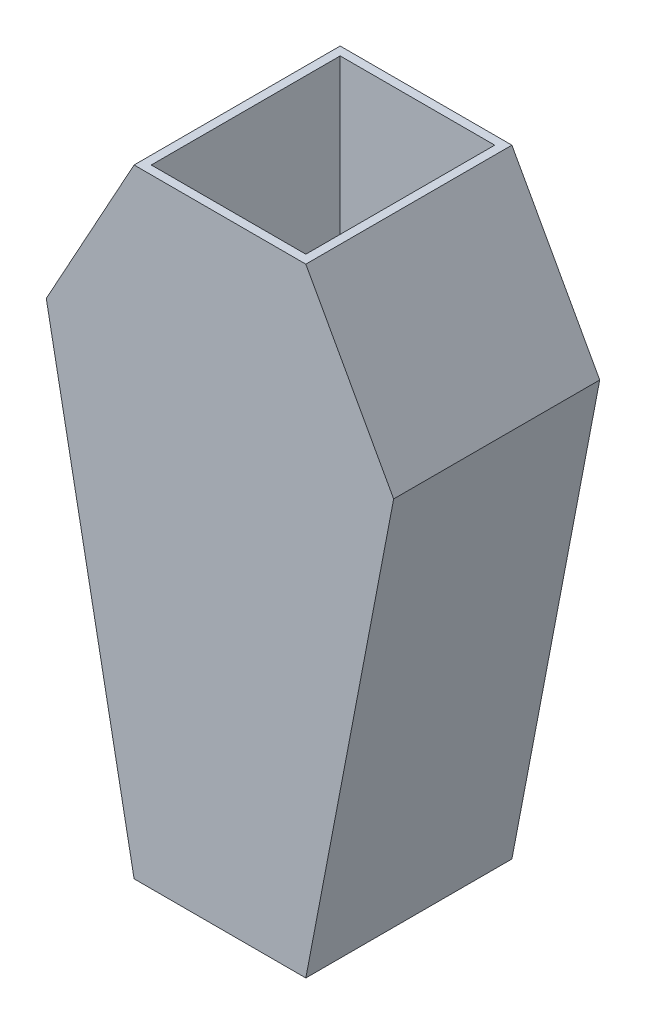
ISO-10303-21;
HEADER;
FILE_DESCRIPTION(('STEP AP214'),'2;1');
FILE_NAME('part.step','',(''),(''),'','','');
FILE_SCHEMA(('AUTOMOTIVE_DESIGN { 1 0 10303 214 1 1 1 1 }'));
ENDSEC;
DATA;
#1=APPLICATION_CONTEXT('core data for automotive mechanical design processes');
#2=APPLICATION_PROTOCOL_DEFINITION('international standard','automotive_design',2000,#1);
#3=PRODUCT_CONTEXT('',#1,'mechanical');
#4=PRODUCT('Part','Part','',(#3));
#5=PRODUCT_RELATED_PRODUCT_CATEGORY('part','',(#4));
#6=PRODUCT_DEFINITION_FORMATION('','',#4);
#7=PRODUCT_DEFINITION_CONTEXT('part definition',#1,'design');
#8=PRODUCT_DEFINITION('design','',#6,#7);
#9=PRODUCT_DEFINITION_SHAPE('','',#8);
#10=(LENGTH_UNIT() NAMED_UNIT(*) SI_UNIT(.MILLI.,.METRE.));
#11=(NAMED_UNIT(*) PLANE_ANGLE_UNIT() SI_UNIT($,.RADIAN.));
#12=(NAMED_UNIT(*) SI_UNIT($,.STERADIAN.) SOLID_ANGLE_UNIT());
#13=UNCERTAINTY_MEASURE_WITH_UNIT(LENGTH_MEASURE(1.E-05),#10,'distance_accuracy_value','');
#14=(GEOMETRIC_REPRESENTATION_CONTEXT(3) GLOBAL_UNCERTAINTY_ASSIGNED_CONTEXT((#13)) GLOBAL_UNIT_ASSIGNED_CONTEXT((#10,
#11,#12)) REPRESENTATION_CONTEXT('',''));
#15=CARTESIAN_POINT('',(0.,0.,0.));
#16=DIRECTION('',(0.,0.,1.));
#17=DIRECTION('',(1.,0.,0.));
#18=AXIS2_PLACEMENT_3D('',#15,#16,#17);
#19=CARTESIAN_POINT('',(0.,228.6,76.2));
#20=DIRECTION('',(0.,1.,0.));
#21=DIRECTION('',(0.,0.,1.));
#22=AXIS2_PLACEMENT_3D('',#19,#20,#21);
#23=PLANE('',#22);
#24=DIRECTION('',(1.,0.,0.));
#25=VECTOR('',#24,1.);
#26=CARTESIAN_POINT('',(0.,228.6,0.));
#27=LINE('',#26,#25);
#28=CARTESIAN_POINT('',(0.,228.6,0.));
#29=VERTEX_POINT('',#28);
#30=CARTESIAN_POINT('',(63.5,228.6,0.));
#31=VERTEX_POINT('',#30);
#32=EDGE_CURVE('E144',#29,#31,#27,.T.);
#33=ORIENTED_EDGE('',*,*,#32,.F.);
#34=DIRECTION('',(0.,0.,-1.));
#35=VECTOR('',#34,1.);
#36=CARTESIAN_POINT('',(0.,228.6,76.2));
#37=LINE('',#36,#35);
#38=CARTESIAN_POINT('',(0.,228.6,76.2));
#39=VERTEX_POINT('',#38);
#40=EDGE_CURVE('E119',#39,#29,#37,.T.);
#41=ORIENTED_EDGE('',*,*,#40,.F.);
#42=DIRECTION('',(1.,0.,0.));
#43=VECTOR('',#42,1.);
#44=CARTESIAN_POINT('',(0.,228.6,76.2));
#45=LINE('',#44,#43);
#46=CARTESIAN_POINT('',(63.5,228.6,76.2));
#47=VERTEX_POINT('',#46);
#48=EDGE_CURVE('E123',#39,#47,#45,.T.);
#49=ORIENTED_EDGE('',*,*,#48,.T.);
#50=DIRECTION('',(0.,0.,-1.));
#51=VECTOR('',#50,1.);
#52=CARTESIAN_POINT('',(63.5,228.6,76.2));
#53=LINE('',#52,#51);
#54=EDGE_CURVE('E108',#47,#31,#53,.T.);
#55=ORIENTED_EDGE('',*,*,#54,.T.);
#56=EDGE_LOOP('',(#33,#41,#49,#55));
#57=FACE_BOUND('',#56,.T.);
#58=DIRECTION('',(1.,0.,0.));
#59=VECTOR('',#58,1.);
#60=CARTESIAN_POINT('',(0.,228.6,3.175));
#61=LINE('',#60,#59);
#62=CARTESIAN_POINT('',(3.175,228.6,3.175));
#63=VERTEX_POINT('',#62);
#64=CARTESIAN_POINT('',(60.325,228.6,3.175));
#65=VERTEX_POINT('',#64);
#66=EDGE_CURVE('E295',#63,#65,#61,.T.);
#67=ORIENTED_EDGE('',*,*,#66,.T.);
#68=DIRECTION('',(0.,0.,1.));
#69=VECTOR('',#68,1.);
#70=CARTESIAN_POINT('',(60.325,228.6,0.));
#71=LINE('',#70,#69);
#72=CARTESIAN_POINT('',(60.325,228.6,73.025));
#73=VERTEX_POINT('',#72);
#74=EDGE_CURVE('E52',#65,#73,#71,.T.);
#75=ORIENTED_EDGE('',*,*,#74,.T.);
#76=DIRECTION('',(1.,0.,0.));
#77=VECTOR('',#76,1.);
#78=CARTESIAN_POINT('',(0.,228.6,73.025));
#79=LINE('',#78,#77);
#80=CARTESIAN_POINT('',(3.17500000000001,228.6,73.025));
#81=VERTEX_POINT('',#80);
#82=EDGE_CURVE('E283',#81,#73,#79,.T.);
#83=ORIENTED_EDGE('',*,*,#82,.F.);
#84=DIRECTION('',(0.,0.,1.));
#85=VECTOR('',#84,1.);
#86=CARTESIAN_POINT('',(3.175,228.6,0.));
#87=LINE('',#86,#85);
#88=EDGE_CURVE('E288',#63,#81,#87,.T.);
#89=ORIENTED_EDGE('',*,*,#88,.F.);
#90=EDGE_LOOP('',(#67,#75,#83,#89));
#91=FACE_BOUND('',#90,.T.);
#92=ADVANCED_FACE('F37',(#57,#91),#23,.T.);
#93=CARTESIAN_POINT('',(0.,0.,76.2));
#94=DIRECTION('',(0.982169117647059,0.187999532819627,0.));
#95=DIRECTION('',(-0.187999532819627,0.982169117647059,0.));
#96=AXIS2_PLACEMENT_3D('',#93,#94,#95);
#97=PLANE('',#96);
#98=DIRECTION('',(0.187999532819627,-0.982169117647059,0.));
#99=VECTOR('',#98,1.);
#100=CARTESIAN_POINT('',(0.,0.,0.));
#101=LINE('',#100,#99);
#102=CARTESIAN_POINT('',(-32.471279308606,169.64025,0.));
#103=VERTEX_POINT('',#102);
#104=CARTESIAN_POINT('',(0.,0.,0.));
#105=VERTEX_POINT('',#104);
#106=EDGE_CURVE('E133',#103,#105,#101,.T.);
#107=ORIENTED_EDGE('',*,*,#106,.T.);
#108=DIRECTION('',(0.,0.,-1.));
#109=VECTOR('',#108,1.);
#110=CARTESIAN_POINT('',(0.,0.,76.2));
#111=LINE('',#110,#109);
#112=CARTESIAN_POINT('',(0.,0.,76.2));
#113=VERTEX_POINT('',#112);
#114=EDGE_CURVE('E11',#113,#105,#111,.T.);
#115=ORIENTED_EDGE('',*,*,#114,.F.);
#116=DIRECTION('',(0.187999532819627,-0.982169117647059,0.));
#117=VECTOR('',#116,1.);
#118=CARTESIAN_POINT('',(0.,0.,76.2));
#119=LINE('',#118,#117);
#120=CARTESIAN_POINT('',(-32.471279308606,169.64025,76.2));
#121=VERTEX_POINT('',#120);
#122=EDGE_CURVE('E147',#121,#113,#119,.T.);
#123=ORIENTED_EDGE('',*,*,#122,.F.);
#124=DIRECTION('',(0.,0.,-1.));
#125=VECTOR('',#124,1.);
#126=CARTESIAN_POINT('',(-32.471279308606,169.64025,76.2));
#127=LINE('',#126,#125);
#128=EDGE_CURVE('E129',#121,#103,#127,.T.);
#129=ORIENTED_EDGE('',*,*,#128,.T.);
#130=EDGE_LOOP('',(#107,#115,#123,#129));
#131=FACE_BOUND('',#130,.T.);
#132=ADVANCED_FACE('F39',(#131),#97,.F.);
#133=CARTESIAN_POINT('',(0.,0.,76.2));
#134=DIRECTION('',(0.,1.,0.));
#135=DIRECTION('',(0.,0.,1.));
#136=AXIS2_PLACEMENT_3D('',#133,#134,#135);
#137=PLANE('',#136);
#138=DIRECTION('',(1.,0.,0.));
#139=VECTOR('',#138,1.);
#140=CARTESIAN_POINT('',(0.,0.,0.));
#141=LINE('',#140,#139);
#142=CARTESIAN_POINT('',(63.5,0.,0.));
#143=VERTEX_POINT('',#142);
#144=EDGE_CURVE('E136',#105,#143,#141,.T.);
#145=ORIENTED_EDGE('',*,*,#144,.T.);
#146=DIRECTION('',(0.,0.,-1.));
#147=VECTOR('',#146,1.);
#148=CARTESIAN_POINT('',(63.5,0.,76.2));
#149=LINE('',#148,#147);
#150=CARTESIAN_POINT('',(63.5,0.,76.2));
#151=VERTEX_POINT('',#150);
#152=EDGE_CURVE('E45',#151,#143,#149,.T.);
#153=ORIENTED_EDGE('',*,*,#152,.F.);
#154=DIRECTION('',(1.,0.,0.));
#155=VECTOR('',#154,1.);
#156=CARTESIAN_POINT('',(0.,0.,76.2));
#157=LINE('',#156,#155);
#158=EDGE_CURVE('E96',#113,#151,#157,.T.);
#159=ORIENTED_EDGE('',*,*,#158,.F.);
#160=ORIENTED_EDGE('',*,*,#114,.T.);
#161=EDGE_LOOP('',(#145,#153,#159,#160));
#162=FACE_BOUND('',#161,.T.);
#163=ADVANCED_FACE('F153',(#162),#137,.F.);
#164=CARTESIAN_POINT('',(61.2556671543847,-11.725105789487,76.2));
#165=DIRECTION('',(0.982169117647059,-0.187999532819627,0.));
#166=DIRECTION('',(0.187999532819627,0.982169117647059,0.));
#167=AXIS2_PLACEMENT_3D('',#164,#165,#166);
#168=PLANE('',#167);
#169=DIRECTION('',(-0.187999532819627,-0.982169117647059,0.));
#170=VECTOR('',#169,1.);
#171=CARTESIAN_POINT('',(61.2556671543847,-11.725105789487,0.));
#172=LINE('',#171,#170);
#173=CARTESIAN_POINT('',(95.971279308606,169.64025,0.));
#174=VERTEX_POINT('',#173);
#175=EDGE_CURVE('E140',#174,#143,#172,.T.);
#176=ORIENTED_EDGE('',*,*,#175,.F.);
#177=DIRECTION('',(0.,0.,-1.));
#178=VECTOR('',#177,1.);
#179=CARTESIAN_POINT('',(95.971279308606,169.64025,76.2));
#180=LINE('',#179,#178);
#181=CARTESIAN_POINT('',(95.971279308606,169.64025,76.2));
#182=VERTEX_POINT('',#181);
#183=EDGE_CURVE('E118',#182,#174,#180,.T.);
#184=ORIENTED_EDGE('',*,*,#183,.F.);
#185=DIRECTION('',(-0.187999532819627,-0.982169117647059,0.));
#186=VECTOR('',#185,1.);
#187=CARTESIAN_POINT('',(61.2556671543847,-11.725105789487,76.2));
#188=LINE('',#187,#186);
#189=EDGE_CURVE('E125',#182,#151,#188,.T.);
#190=ORIENTED_EDGE('',*,*,#189,.T.);
#191=ORIENTED_EDGE('',*,*,#152,.T.);
#192=EDGE_LOOP('',(#176,#184,#190,#191));
#193=FACE_BOUND('',#192,.T.);
#194=ADVANCED_FACE('F152',(#193),#168,.T.);
#195=CARTESIAN_POINT('',(145.320955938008,80.0335372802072,76.2));
#196=DIRECTION('',(0.875943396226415,0.482413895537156,0.));
#197=DIRECTION('',(-0.482413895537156,0.875943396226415,0.));
#198=AXIS2_PLACEMENT_3D('',#195,#196,#197);
#199=PLANE('',#198);
#200=DIRECTION('',(0.482413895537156,-0.875943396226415,0.));
#201=VECTOR('',#200,1.);
#202=CARTESIAN_POINT('',(145.320955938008,80.0335372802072,0.));
#203=LINE('',#202,#201);
#204=EDGE_CURVE('E113',#31,#174,#203,.T.);
#205=ORIENTED_EDGE('',*,*,#204,.F.);
#206=ORIENTED_EDGE('',*,*,#54,.F.);
#207=DIRECTION('',(0.482413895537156,-0.875943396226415,0.));
#208=VECTOR('',#207,1.);
#209=CARTESIAN_POINT('',(145.320955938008,80.0335372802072,76.2));
#210=LINE('',#209,#208);
#211=EDGE_CURVE('E111',#47,#182,#210,.T.);
#212=ORIENTED_EDGE('',*,*,#211,.T.);
#213=ORIENTED_EDGE('',*,*,#183,.T.);
#214=EDGE_LOOP('',(#205,#206,#212,#213));
#215=FACE_BOUND('',#214,.T.);
#216=ADVANCED_FACE('F110',(#215),#199,.T.);
#217=CARTESIAN_POINT('',(-96.5988770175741,53.2005158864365,76.2));
#218=DIRECTION('',(0.875943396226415,-0.482413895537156,0.));
#219=DIRECTION('',(0.482413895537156,0.875943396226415,0.));
#220=AXIS2_PLACEMENT_3D('',#217,#218,#219);
#221=PLANE('',#220);
#222=DIRECTION('',(-0.482413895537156,-0.875943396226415,0.));
#223=VECTOR('',#222,1.);
#224=CARTESIAN_POINT('',(-96.5988770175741,53.2005158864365,0.));
#225=LINE('',#224,#223);
#226=EDGE_CURVE('E88',#29,#103,#225,.T.);
#227=ORIENTED_EDGE('',*,*,#226,.T.);
#228=ORIENTED_EDGE('',*,*,#128,.F.);
#229=DIRECTION('',(-0.482413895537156,-0.875943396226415,0.));
#230=VECTOR('',#229,1.);
#231=CARTESIAN_POINT('',(-96.5988770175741,53.2005158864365,76.2));
#232=LINE('',#231,#230);
#233=EDGE_CURVE('E61',#39,#121,#232,.T.);
#234=ORIENTED_EDGE('',*,*,#233,.F.);
#235=ORIENTED_EDGE('',*,*,#40,.T.);
#236=EDGE_LOOP('',(#227,#228,#234,#235));
#237=FACE_BOUND('',#236,.T.);
#238=ADVANCED_FACE('F160',(#237),#221,.F.);
#239=CARTESIAN_POINT('',(0.,0.,76.2));
#240=DIRECTION('',(0.,0.,1.));
#241=DIRECTION('',(1.,0.,0.));
#242=AXIS2_PLACEMENT_3D('',#239,#240,#241);
#243=PLANE('',#242);
#244=ORIENTED_EDGE('',*,*,#122,.T.);
#245=ORIENTED_EDGE('',*,*,#158,.T.);
#246=ORIENTED_EDGE('',*,*,#189,.F.);
#247=ORIENTED_EDGE('',*,*,#211,.F.);
#248=ORIENTED_EDGE('',*,*,#48,.F.);
#249=ORIENTED_EDGE('',*,*,#233,.T.);
#250=EDGE_LOOP('',(#244,#245,#246,#247,#248,#249));
#251=FACE_BOUND('',#250,.T.);
#252=ADVANCED_FACE('F122',(#251),#243,.T.);
#253=CARTESIAN_POINT('',(0.,0.,0.));
#254=DIRECTION('',(0.,0.,1.));
#255=DIRECTION('',(1.,0.,0.));
#256=AXIS2_PLACEMENT_3D('',#253,#254,#255);
#257=PLANE('',#256);
#258=ORIENTED_EDGE('',*,*,#106,.F.);
#259=ORIENTED_EDGE('',*,*,#226,.F.);
#260=ORIENTED_EDGE('',*,*,#32,.T.);
#261=ORIENTED_EDGE('',*,*,#204,.T.);
#262=ORIENTED_EDGE('',*,*,#175,.T.);
#263=ORIENTED_EDGE('',*,*,#144,.F.);
#264=EDGE_LOOP('',(#258,#259,#260,#261,#262,#263));
#265=FACE_BOUND('',#264,.T.);
#266=ADVANCED_FACE('F157',(#265),#257,.F.);
#267=CARTESIAN_POINT('',(60.325,12.7,0.));
#268=DIRECTION('',(-1.,0.,0.));
#269=DIRECTION('',(0.,0.,1.));
#270=AXIS2_PLACEMENT_3D('',#267,#268,#269);
#271=PLANE('',#270);
#272=ORIENTED_EDGE('',*,*,#74,.F.);
#273=DIRECTION('',(0.,1.,0.));
#274=VECTOR('',#273,1.);
#275=CARTESIAN_POINT('',(60.325,12.7,3.175));
#276=LINE('',#275,#274);
#277=CARTESIAN_POINT('',(60.325,12.7,3.175));
#278=VERTEX_POINT('',#277);
#279=EDGE_CURVE('E293',#278,#65,#276,.T.);
#280=ORIENTED_EDGE('',*,*,#279,.F.);
#281=DIRECTION('',(0.,0.,1.));
#282=VECTOR('',#281,1.);
#283=CARTESIAN_POINT('',(60.325,12.7,0.));
#284=LINE('',#283,#282);
#285=CARTESIAN_POINT('',(60.325,12.7,73.025));
#286=VERTEX_POINT('',#285);
#287=EDGE_CURVE('E273',#278,#286,#284,.T.);
#288=ORIENTED_EDGE('',*,*,#287,.T.);
#289=DIRECTION('',(0.,1.,0.));
#290=VECTOR('',#289,1.);
#291=CARTESIAN_POINT('',(60.325,12.7,73.025));
#292=LINE('',#291,#290);
#293=EDGE_CURVE('E137',#286,#73,#292,.T.);
#294=ORIENTED_EDGE('',*,*,#293,.T.);
#295=EDGE_LOOP('',(#272,#280,#288,#294));
#296=FACE_BOUND('',#295,.T.);
#297=ADVANCED_FACE('F211',(#296),#271,.T.);
#298=CARTESIAN_POINT('',(0.,12.7,73.025));
#299=DIRECTION('',(0.,0.,1.));
#300=DIRECTION('',(1.,0.,0.));
#301=AXIS2_PLACEMENT_3D('',#298,#299,#300);
#302=PLANE('',#301);
#303=ORIENTED_EDGE('',*,*,#82,.T.);
#304=ORIENTED_EDGE('',*,*,#293,.F.);
#305=DIRECTION('',(1.,0.,0.));
#306=VECTOR('',#305,1.);
#307=CARTESIAN_POINT('',(0.,12.7,73.025));
#308=LINE('',#307,#306);
#309=CARTESIAN_POINT('',(3.17500000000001,12.7,73.025));
#310=VERTEX_POINT('',#309);
#311=EDGE_CURVE('E280',#310,#286,#308,.T.);
#312=ORIENTED_EDGE('',*,*,#311,.F.);
#313=DIRECTION('',(0.,1.,0.));
#314=VECTOR('',#313,1.);
#315=CARTESIAN_POINT('',(3.17500000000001,12.7,73.025));
#316=LINE('',#315,#314);
#317=EDGE_CURVE('E301',#310,#81,#316,.T.);
#318=ORIENTED_EDGE('',*,*,#317,.T.);
#319=EDGE_LOOP('',(#303,#304,#312,#318));
#320=FACE_BOUND('',#319,.T.);
#321=ADVANCED_FACE('F225',(#320),#302,.F.);
#322=CARTESIAN_POINT('',(3.175,12.7,0.));
#323=DIRECTION('',(-1.,0.,0.));
#324=DIRECTION('',(0.,0.,1.));
#325=AXIS2_PLACEMENT_3D('',#322,#323,#324);
#326=PLANE('',#325);
#327=ORIENTED_EDGE('',*,*,#88,.T.);
#328=ORIENTED_EDGE('',*,*,#317,.F.);
#329=DIRECTION('',(0.,0.,1.));
#330=VECTOR('',#329,1.);
#331=CARTESIAN_POINT('',(3.175,12.7,0.));
#332=LINE('',#331,#330);
#333=CARTESIAN_POINT('',(3.175,12.7,3.175));
#334=VERTEX_POINT('',#333);
#335=EDGE_CURVE('E285',#334,#310,#332,.T.);
#336=ORIENTED_EDGE('',*,*,#335,.F.);
#337=DIRECTION('',(0.,1.,0.));
#338=VECTOR('',#337,1.);
#339=CARTESIAN_POINT('',(3.175,12.7,3.175));
#340=LINE('',#339,#338);
#341=EDGE_CURVE('E304',#334,#63,#340,.T.);
#342=ORIENTED_EDGE('',*,*,#341,.T.);
#343=EDGE_LOOP('',(#327,#328,#336,#342));
#344=FACE_BOUND('',#343,.T.);
#345=ADVANCED_FACE('F234',(#344),#326,.F.);
#346=CARTESIAN_POINT('',(0.,12.7,3.175));
#347=DIRECTION('',(0.,0.,1.));
#348=DIRECTION('',(1.,0.,0.));
#349=AXIS2_PLACEMENT_3D('',#346,#347,#348);
#350=PLANE('',#349);
#351=ORIENTED_EDGE('',*,*,#66,.F.);
#352=ORIENTED_EDGE('',*,*,#341,.F.);
#353=DIRECTION('',(1.,0.,0.));
#354=VECTOR('',#353,1.);
#355=CARTESIAN_POINT('',(0.,12.7,3.175));
#356=LINE('',#355,#354);
#357=EDGE_CURVE('E277',#334,#278,#356,.T.);
#358=ORIENTED_EDGE('',*,*,#357,.T.);
#359=ORIENTED_EDGE('',*,*,#279,.T.);
#360=EDGE_LOOP('',(#351,#352,#358,#359));
#361=FACE_BOUND('',#360,.T.);
#362=ADVANCED_FACE('F244',(#361),#350,.T.);
#363=CARTESIAN_POINT('',(0.,12.7,0.));
#364=DIRECTION('',(0.,1.,0.));
#365=DIRECTION('',(0.,0.,1.));
#366=AXIS2_PLACEMENT_3D('',#363,#364,#365);
#367=PLANE('',#366);
#368=ORIENTED_EDGE('',*,*,#287,.F.);
#369=ORIENTED_EDGE('',*,*,#357,.F.);
#370=ORIENTED_EDGE('',*,*,#335,.T.);
#371=ORIENTED_EDGE('',*,*,#311,.T.);
#372=EDGE_LOOP('',(#368,#369,#370,#371));
#373=FACE_BOUND('',#372,.T.);
#374=ADVANCED_FACE('F254',(#373),#367,.T.);
#375=CLOSED_SHELL('',(#92,#132,#163,#194,#216,#238,#252,#266,#297,#321,#345,#362,#374));
#376=MANIFOLD_SOLID_BREP('B2',#375);
#377=ADVANCED_BREP_SHAPE_REPRESENTATION('',(#18,#376),#14);
#378=SHAPE_DEFINITION_REPRESENTATION(#9,#377);
ENDSEC;
END-ISO-10303-21;
